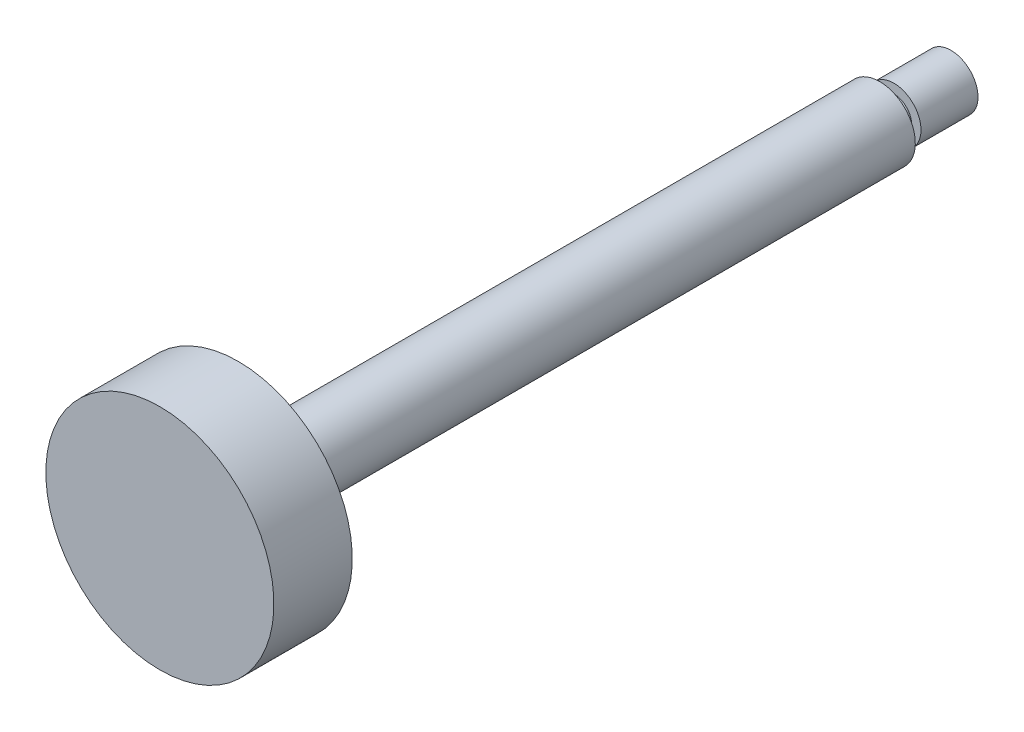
ISO-10303-21;
HEADER;
FILE_DESCRIPTION(('STEP AP214'),'2;1');
FILE_NAME('part.step','',(''),(''),'','','');
FILE_SCHEMA(('AUTOMOTIVE_DESIGN { 1 0 10303 214 1 1 1 1 }'));
ENDSEC;
DATA;
#1=APPLICATION_CONTEXT('core data for automotive mechanical design processes');
#2=APPLICATION_PROTOCOL_DEFINITION('international standard','automotive_design',2000,#1);
#3=PRODUCT_CONTEXT('',#1,'mechanical');
#4=PRODUCT('Part','Part','',(#3));
#5=PRODUCT_RELATED_PRODUCT_CATEGORY('part','',(#4));
#6=PRODUCT_DEFINITION_FORMATION('','',#4);
#7=PRODUCT_DEFINITION_CONTEXT('part definition',#1,'design');
#8=PRODUCT_DEFINITION('design','',#6,#7);
#9=PRODUCT_DEFINITION_SHAPE('','',#8);
#10=(LENGTH_UNIT() NAMED_UNIT(*) SI_UNIT(.MILLI.,.METRE.));
#11=(NAMED_UNIT(*) PLANE_ANGLE_UNIT() SI_UNIT($,.RADIAN.));
#12=(NAMED_UNIT(*) SI_UNIT($,.STERADIAN.) SOLID_ANGLE_UNIT());
#13=UNCERTAINTY_MEASURE_WITH_UNIT(LENGTH_MEASURE(1.E-05),#10,'distance_accuracy_value','');
#14=(GEOMETRIC_REPRESENTATION_CONTEXT(3) GLOBAL_UNCERTAINTY_ASSIGNED_CONTEXT((#13)) GLOBAL_UNIT_ASSIGNED_CONTEXT((#10,
#11,#12)) REPRESENTATION_CONTEXT('',''));
#15=CARTESIAN_POINT('',(0.,0.,0.));
#16=DIRECTION('',(0.,0.,1.));
#17=DIRECTION('',(1.,0.,0.));
#18=AXIS2_PLACEMENT_3D('',#15,#16,#17);
#19=CARTESIAN_POINT('',(0.,-5.,10.));
#20=DIRECTION('',(0.,0.,-1.));
#21=DIRECTION('',(0.,-1.,0.));
#22=AXIS2_PLACEMENT_3D('',#19,#20,#21);
#23=PLANE('',#22);
#24=CARTESIAN_POINT('',(0.,0.,10.));
#25=DIRECTION('',(0.,0.,1.));
#26=DIRECTION('',(0.,1.,0.));
#27=AXIS2_PLACEMENT_3D('',#24,#25,#26);
#28=CIRCLE('',#27,2.5);
#29=CARTESIAN_POINT('',(0.,2.5,10.));
#30=VERTEX_POINT('',#29);
#31=EDGE_CURVE('E40',#30,#30,#28,.T.);
#32=ORIENTED_EDGE('',*,*,#31,.T.);
#33=EDGE_LOOP('',(#32));
#34=FACE_BOUND('',#33,.T.);
#35=CARTESIAN_POINT('',(0.,0.,10.));
#36=DIRECTION('',(0.,0.,1.));
#37=DIRECTION('',(0.,1.,0.));
#38=AXIS2_PLACEMENT_3D('',#35,#36,#37);
#39=CIRCLE('',#38,5.);
#40=CARTESIAN_POINT('',(0.,5.,10.));
#41=VERTEX_POINT('',#40);
#42=EDGE_CURVE('E8',#41,#41,#39,.T.);
#43=ORIENTED_EDGE('',*,*,#42,.F.);
#44=EDGE_LOOP('',(#43));
#45=FACE_BOUND('',#44,.T.);
#46=ADVANCED_FACE('F12',(#34,#45),#23,.T.);
#47=CARTESIAN_POINT('',(0.,0.,20.));
#48=DIRECTION('',(0.,0.,1.));
#49=DIRECTION('',(0.,1.,0.));
#50=AXIS2_PLACEMENT_3D('',#47,#48,#49);
#51=CYLINDRICAL_SURFACE('',#50,5.);
#52=CARTESIAN_POINT('',(0.,0.,100.));
#53=DIRECTION('',(0.,0.,1.));
#54=DIRECTION('',(0.,1.,0.));
#55=AXIS2_PLACEMENT_3D('',#52,#53,#54);
#56=CIRCLE('',#55,5.);
#57=CARTESIAN_POINT('',(0.,5.,100.));
#58=VERTEX_POINT('',#57);
#59=EDGE_CURVE('E18',#58,#58,#56,.T.);
#60=ORIENTED_EDGE('',*,*,#59,.F.);
#61=EDGE_LOOP('',(#60));
#62=FACE_BOUND('',#61,.T.);
#63=ORIENTED_EDGE('',*,*,#42,.T.);
#64=EDGE_LOOP('',(#63));
#65=FACE_BOUND('',#64,.T.);
#66=ADVANCED_FACE('F59',(#62,#65),#51,.T.);
#67=CARTESIAN_POINT('',(0.,-16.,100.));
#68=DIRECTION('',(0.,0.,-1.));
#69=DIRECTION('',(0.,-1.,0.));
#70=AXIS2_PLACEMENT_3D('',#67,#68,#69);
#71=PLANE('',#70);
#72=ORIENTED_EDGE('',*,*,#59,.T.);
#73=EDGE_LOOP('',(#72));
#74=FACE_BOUND('',#73,.T.);
#75=CARTESIAN_POINT('',(0.,0.,100.));
#76=DIRECTION('',(0.,0.,1.));
#77=DIRECTION('',(0.,1.,0.));
#78=AXIS2_PLACEMENT_3D('',#75,#76,#77);
#79=CIRCLE('',#78,16.);
#80=CARTESIAN_POINT('',(0.,16.,100.));
#81=VERTEX_POINT('',#80);
#82=EDGE_CURVE('E22',#81,#81,#79,.T.);
#83=ORIENTED_EDGE('',*,*,#82,.F.);
#84=EDGE_LOOP('',(#83));
#85=FACE_BOUND('',#84,.T.);
#86=ADVANCED_FACE('F63',(#74,#85),#71,.T.);
#87=CARTESIAN_POINT('',(0.,0.,20.));
#88=DIRECTION('',(0.,0.,1.));
#89=DIRECTION('',(0.,1.,0.));
#90=AXIS2_PLACEMENT_3D('',#87,#88,#89);
#91=CYLINDRICAL_SURFACE('',#90,16.);
#92=CARTESIAN_POINT('',(0.,0.,111.));
#93=DIRECTION('',(0.,0.,1.));
#94=DIRECTION('',(0.,1.,0.));
#95=AXIS2_PLACEMENT_3D('',#92,#93,#94);
#96=CIRCLE('',#95,16.);
#97=CARTESIAN_POINT('',(0.,16.,111.));
#98=VERTEX_POINT('',#97);
#99=EDGE_CURVE('E26',#98,#98,#96,.T.);
#100=ORIENTED_EDGE('',*,*,#99,.F.);
#101=EDGE_LOOP('',(#100));
#102=FACE_BOUND('',#101,.T.);
#103=ORIENTED_EDGE('',*,*,#82,.T.);
#104=EDGE_LOOP('',(#103));
#105=FACE_BOUND('',#104,.T.);
#106=ADVANCED_FACE('F68',(#102,#105),#91,.T.);
#107=CARTESIAN_POINT('',(0.,-16.,111.));
#108=DIRECTION('',(0.,0.,-1.));
#109=DIRECTION('',(0.,-1.,0.));
#110=AXIS2_PLACEMENT_3D('',#107,#108,#109);
#111=PLANE('',#110);
#112=ORIENTED_EDGE('',*,*,#99,.T.);
#113=EDGE_LOOP('',(#112));
#114=FACE_BOUND('',#113,.T.);
#115=ADVANCED_FACE('F73',(#114),#111,.F.);
#116=CARTESIAN_POINT('',(0.,-3.8,0.));
#117=DIRECTION('',(0.,0.,-1.));
#118=DIRECTION('',(0.,-1.,0.));
#119=AXIS2_PLACEMENT_3D('',#116,#117,#118);
#120=PLANE('',#119);
#121=CARTESIAN_POINT('',(0.,0.,0.));
#122=DIRECTION('',(0.,0.,1.));
#123=DIRECTION('',(0.,1.,0.));
#124=AXIS2_PLACEMENT_3D('',#121,#122,#123);
#125=CIRCLE('',#124,3.8);
#126=CARTESIAN_POINT('',(0.,3.8,0.));
#127=VERTEX_POINT('',#126);
#128=EDGE_CURVE('E31',#127,#127,#125,.T.);
#129=ORIENTED_EDGE('',*,*,#128,.F.);
#130=EDGE_LOOP('',(#129));
#131=FACE_BOUND('',#130,.T.);
#132=ADVANCED_FACE('F77',(#131),#120,.T.);
#133=CARTESIAN_POINT('',(0.,0.,20.));
#134=DIRECTION('',(0.,0.,1.));
#135=DIRECTION('',(0.,1.,0.));
#136=AXIS2_PLACEMENT_3D('',#133,#134,#135);
#137=CYLINDRICAL_SURFACE('',#136,3.8);
#138=ORIENTED_EDGE('',*,*,#128,.T.);
#139=EDGE_LOOP('',(#138));
#140=FACE_BOUND('',#139,.T.);
#141=CARTESIAN_POINT('',(0.,0.,8.));
#142=DIRECTION('',(0.,0.,1.));
#143=DIRECTION('',(0.,1.,0.));
#144=AXIS2_PLACEMENT_3D('',#141,#142,#143);
#145=CIRCLE('',#144,3.8);
#146=CARTESIAN_POINT('',(0.,3.8,8.));
#147=VERTEX_POINT('',#146);
#148=EDGE_CURVE('E34',#147,#147,#145,.T.);
#149=ORIENTED_EDGE('',*,*,#148,.F.);
#150=EDGE_LOOP('',(#149));
#151=FACE_BOUND('',#150,.T.);
#152=ADVANCED_FACE('F55',(#140,#151),#137,.T.);
#153=CARTESIAN_POINT('',(0.,-2.5,8.));
#154=DIRECTION('',(0.,0.,1.));
#155=DIRECTION('',(0.,1.,0.));
#156=AXIS2_PLACEMENT_3D('',#153,#154,#155);
#157=PLANE('',#156);
#158=ORIENTED_EDGE('',*,*,#148,.T.);
#159=EDGE_LOOP('',(#158));
#160=FACE_BOUND('',#159,.T.);
#161=CARTESIAN_POINT('',(0.,0.,8.));
#162=DIRECTION('',(0.,0.,1.));
#163=DIRECTION('',(0.,1.,0.));
#164=AXIS2_PLACEMENT_3D('',#161,#162,#163);
#165=CIRCLE('',#164,2.5);
#166=CARTESIAN_POINT('',(0.,2.5,8.));
#167=VERTEX_POINT('',#166);
#168=EDGE_CURVE('E37',#167,#167,#165,.T.);
#169=ORIENTED_EDGE('',*,*,#168,.F.);
#170=EDGE_LOOP('',(#169));
#171=FACE_BOUND('',#170,.T.);
#172=ADVANCED_FACE('F48',(#160,#171),#157,.T.);
#173=CARTESIAN_POINT('',(0.,0.,20.));
#174=DIRECTION('',(0.,0.,1.));
#175=DIRECTION('',(0.,1.,0.));
#176=AXIS2_PLACEMENT_3D('',#173,#174,#175);
#177=CYLINDRICAL_SURFACE('',#176,2.5);
#178=ORIENTED_EDGE('',*,*,#168,.T.);
#179=EDGE_LOOP('',(#178));
#180=FACE_BOUND('',#179,.T.);
#181=ORIENTED_EDGE('',*,*,#31,.F.);
#182=EDGE_LOOP('',(#181));
#183=FACE_BOUND('',#182,.T.);
#184=ADVANCED_FACE('F46',(#180,#183),#177,.T.);
#185=CLOSED_SHELL('',(#46,#66,#86,#106,#115,#132,#152,#172,#184));
#186=MANIFOLD_SOLID_BREP('B1',#185);
#187=ADVANCED_BREP_SHAPE_REPRESENTATION('',(#18,#186),#14);
#188=SHAPE_DEFINITION_REPRESENTATION(#9,#187);
ENDSEC;
END-ISO-10303-21;
